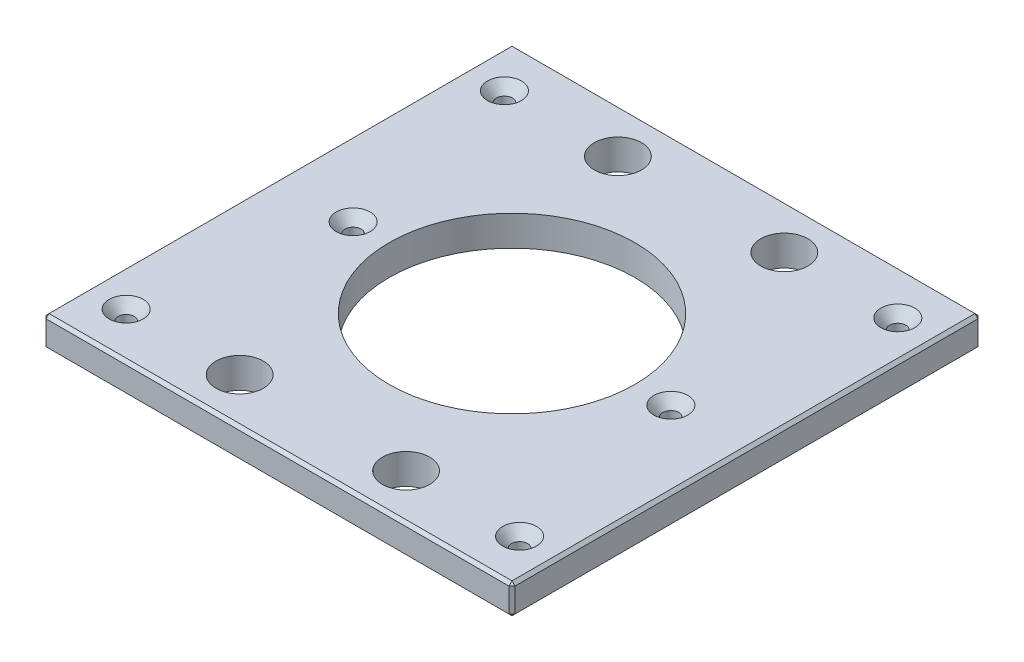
from build123d import *

# Parameters (mm, degrees)
SKETCH1_W                                        = 196.85
SKETCH1_H                                        = 196.85
BOSS_EXTRUDE1_DEPTH                              = 12.7
SKETCH13_R                                       = 51.562
CUT_EXTRUDE6_DEPTH                               = 140.772140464
F_25_32_0_78125_DIAMETER_HOLE1_D                 = 19.84375
CHAMFER2_SIZE                                    = 1.27
CSK_FOR_1_4_FLAT_HEAD_MACHINE_SCREW1_D           = 6.7564
CSK_FOR_1_4_FLAT_HEAD_MACHINE_SCREW1_CSINK_D     = 14.2748
CSK_FOR_1_4_FLAT_HEAD_MACHINE_SCREW1_CSINK_ANGLE = 82


with BuildPart() as part:
    # Sketch1 → Boss-Extrude1 (new body)
    with BuildSketch(Plane(origin=(0, 0, 0), x_dir=(1, 0, 0), z_dir=(0, 1, 0))):
        Rectangle(SKETCH1_W, SKETCH1_H)
    extrude(amount=BOSS_EXTRUDE1_DEPTH)

    # Sketch13 → Cut-Extrude6 (cut, through all)
    with BuildSketch(Plane(origin=(0, 12.7, 0), x_dir=(1, 0, 0), z_dir=(0, 1, 0))):
        with Locations(Location((0, 0, 0), (0, 0, 270))):
            Circle(SKETCH13_R)
    extrude(amount=-CUT_EXTRUDE6_DEPTH, mode=Mode.SUBTRACT)

    # 25_32 _0.78125_ Diameter Hole1 (through all)
    with Locations(Plane(origin=(0, 12.7, 0), x_dir=(1, 0, 0), z_dir=(0, 1, 0))):
        with Locations((34.925, 79.375), (-34.925, 79.375), (34.925, -79.375), (-34.925, -79.375)):
            Hole(F_25_32_0_78125_DIAMETER_HOLE1_D / 2)

    # Chamfer2
    chamfer2_edges = [part.edges().sort_by_distance(p)[0] for p in [
        (98.425, 12.7, 0),
        (0, 12.7, -98.425),
        (-98.425, 12.7, 0),
        (0, 0, -98.425),
        (98.425, 0, 0),
        (0, 0, 98.425),
        (-98.425, 0, 0),
        (0, 12.7, 98.425),
        (-98.425, 6.35, -98.425),
        (98.425, 6.35, -98.425),
        (98.425, 6.35, 98.425),
        (-98.425, 6.35, 98.425),
    ]]
    chamfer(chamfer2_edges, length=CHAMFER2_SIZE)

    # CSK for 1_4 Flat Head Machine Screw1 (through all)
    with Locations(Plane(origin=(0, 12.7, 0), x_dir=(1, 0, 0), z_dir=(0, 1, 0))):
        with Locations((82.55, 79.375), (82.55, -79.375), (-82.55, -79.375), (-66.675, 0), (66.675, 0), (-82.55, 79.375), (-34.925, 79.375), (-34.925, -79.375)):
            CounterSinkHole(CSK_FOR_1_4_FLAT_HEAD_MACHINE_SCREW1_D / 2, CSK_FOR_1_4_FLAT_HEAD_MACHINE_SCREW1_CSINK_D / 2, counter_sink_angle=CSK_FOR_1_4_FLAT_HEAD_MACHINE_SCREW1_CSINK_ANGLE)


solid = part.part
